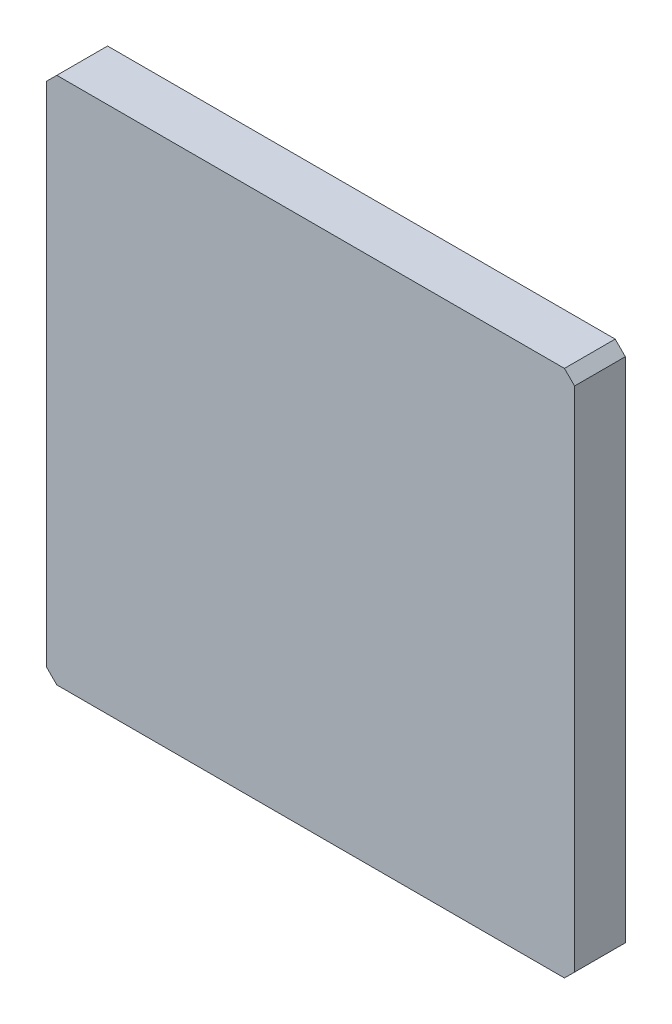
from build123d import *

# Parameters (mm, degrees)
SKETCH_1_W      = 5.2
SKETCH_1_H      = 5.2
EXTRUDE_1_DEPTH = 0.5
CHAMFER_1_SIZE  = 0.1


with BuildPart() as part:
    # Sketch 1 → Extrude 1 (new body)
    with BuildSketch(Plane.XY):
        Rectangle(SKETCH_1_W, SKETCH_1_H)
    extrude(amount=EXTRUDE_1_DEPTH)

    # Chamfer 1
    chamfer_1_edges = [part.edges().sort_by_distance(p)[0] for p in [
        (2.6, -2.6, 0.25),
        (-2.6, -2.6, 0.25),
        (-2.6, 2.6, 0.25),
        (2.6, 2.6, 0.25),
    ]]
    chamfer(chamfer_1_edges, length=CHAMFER_1_SIZE)


solid = part.part
